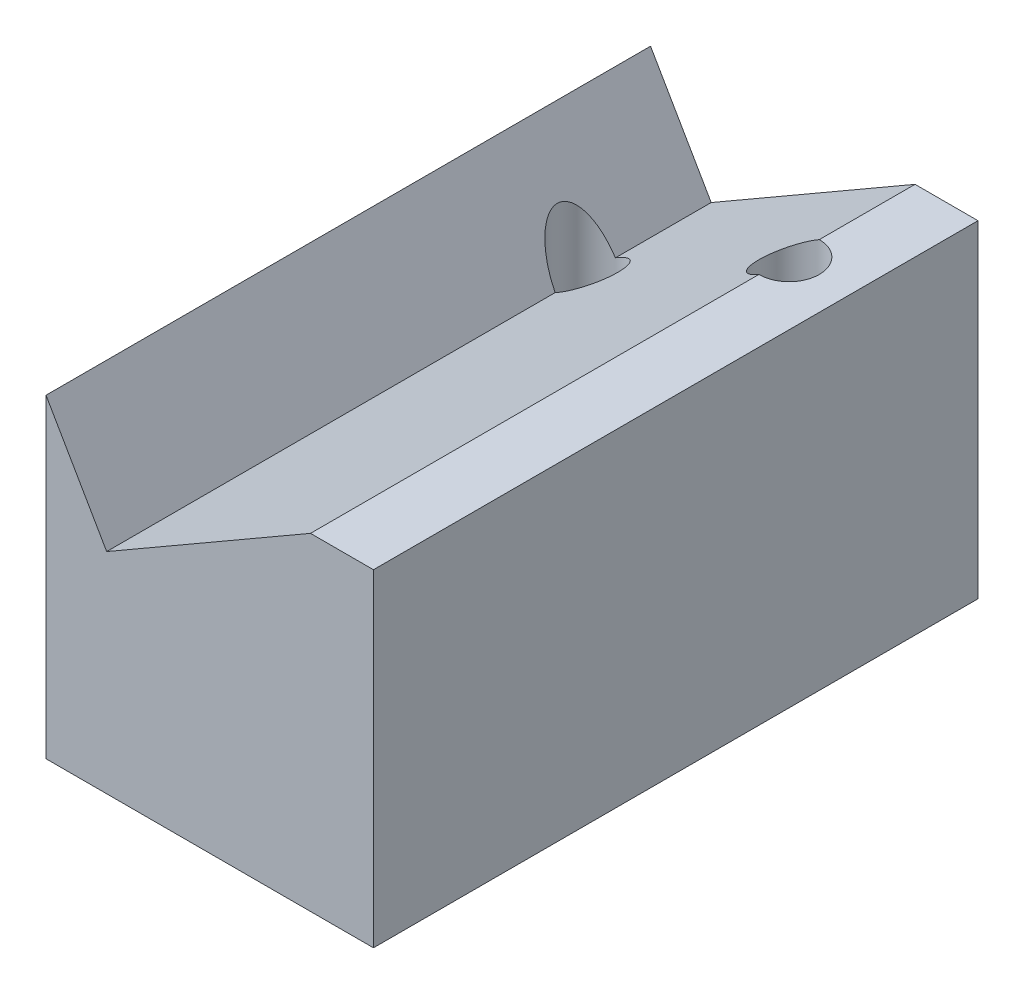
ISO-10303-21;
HEADER;
FILE_DESCRIPTION(('STEP AP214'),'2;1');
FILE_NAME('part.step','',(''),(''),'','','');
FILE_SCHEMA(('AUTOMOTIVE_DESIGN { 1 0 10303 214 1 1 1 1 }'));
ENDSEC;
DATA;
#1=APPLICATION_CONTEXT('core data for automotive mechanical design processes');
#2=APPLICATION_PROTOCOL_DEFINITION('international standard','automotive_design',2000,#1);
#3=PRODUCT_CONTEXT('',#1,'mechanical');
#4=PRODUCT('Part','Part','',(#3));
#5=PRODUCT_RELATED_PRODUCT_CATEGORY('part','',(#4));
#6=PRODUCT_DEFINITION_FORMATION('','',#4);
#7=PRODUCT_DEFINITION_CONTEXT('part definition',#1,'design');
#8=PRODUCT_DEFINITION('design','',#6,#7);
#9=PRODUCT_DEFINITION_SHAPE('','',#8);
#10=(LENGTH_UNIT() NAMED_UNIT(*) SI_UNIT(.MILLI.,.METRE.));
#11=(NAMED_UNIT(*) PLANE_ANGLE_UNIT() SI_UNIT($,.RADIAN.));
#12=(NAMED_UNIT(*) SI_UNIT($,.STERADIAN.) SOLID_ANGLE_UNIT());
#13=UNCERTAINTY_MEASURE_WITH_UNIT(LENGTH_MEASURE(1.E-05),#10,'distance_accuracy_value','');
#14=(GEOMETRIC_REPRESENTATION_CONTEXT(3) GLOBAL_UNCERTAINTY_ASSIGNED_CONTEXT((#13)) GLOBAL_UNIT_ASSIGNED_CONTEXT((#10,
#11,#12)) REPRESENTATION_CONTEXT('',''));
#15=CARTESIAN_POINT('',(0.,0.,0.));
#16=DIRECTION('',(0.,0.,1.));
#17=DIRECTION('',(1.,0.,0.));
#18=AXIS2_PLACEMENT_3D('',#15,#16,#17);
#19=CARTESIAN_POINT('',(-6.50000000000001,0.,24.));
#20=DIRECTION('',(1.,0.,0.));
#21=DIRECTION('',(0.,0.,-1.));
#22=AXIS2_PLACEMENT_3D('',#19,#20,#21);
#23=PLANE('',#22);
#24=DIRECTION('',(0.,-1.,0.));
#25=VECTOR('',#24,1.);
#26=CARTESIAN_POINT('',(-6.50000000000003,0.,0.));
#27=LINE('',#26,#25);
#28=CARTESIAN_POINT('',(-6.50000000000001,12.5,0.));
#29=VERTEX_POINT('',#28);
#30=CARTESIAN_POINT('',(-6.50000000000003,0.,0.));
#31=VERTEX_POINT('',#30);
#32=EDGE_CURVE('E161',#29,#31,#27,.T.);
#33=ORIENTED_EDGE('',*,*,#32,.T.);
#34=DIRECTION('',(0.,0.,-1.));
#35=VECTOR('',#34,1.);
#36=CARTESIAN_POINT('',(-6.50000000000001,0.,24.));
#37=LINE('',#36,#35);
#38=CARTESIAN_POINT('',(-6.50000000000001,0.,24.));
#39=VERTEX_POINT('',#38);
#40=EDGE_CURVE('E120',#39,#31,#37,.T.);
#41=ORIENTED_EDGE('',*,*,#40,.F.);
#42=DIRECTION('',(0.,-1.,0.));
#43=VECTOR('',#42,1.);
#44=CARTESIAN_POINT('',(-6.50000000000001,0.,24.));
#45=LINE('',#44,#43);
#46=CARTESIAN_POINT('',(-6.50000000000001,12.5,24.));
#47=VERTEX_POINT('',#46);
#48=EDGE_CURVE('E142',#47,#39,#45,.T.);
#49=ORIENTED_EDGE('',*,*,#48,.F.);
#50=DIRECTION('',(0.,0.,-1.));
#51=VECTOR('',#50,1.);
#52=CARTESIAN_POINT('',(-6.50000000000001,12.5,24.));
#53=LINE('',#52,#51);
#54=EDGE_CURVE('E109',#47,#29,#53,.T.);
#55=ORIENTED_EDGE('',*,*,#54,.T.);
#56=EDGE_LOOP('',(#33,#41,#49,#55));
#57=FACE_BOUND('',#56,.T.);
#58=ADVANCED_FACE('F28',(#57),#23,.F.);
#59=CARTESIAN_POINT('',(-6.50000000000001,0.,24.));
#60=DIRECTION('',(0.,1.,0.));
#61=DIRECTION('',(0.,0.,1.));
#62=AXIS2_PLACEMENT_3D('',#59,#60,#61);
#63=PLANE('',#62);
#64=CARTESIAN_POINT('',(-4.,0.,5.));
#65=DIRECTION('',(0.,-1.,0.));
#66=DIRECTION('',(0.,0.,-1.));
#67=AXIS2_PLACEMENT_3D('',#64,#65,#66);
#68=CIRCLE('',#67,1.19999999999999);
#69=CARTESIAN_POINT('',(-4.,0.,3.80000000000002));
#70=VERTEX_POINT('',#69);
#71=EDGE_CURVE('E100',#70,#70,#68,.T.);
#72=ORIENTED_EDGE('',*,*,#71,.F.);
#73=EDGE_LOOP('',(#72));
#74=FACE_BOUND('',#73,.T.);
#75=CARTESIAN_POINT('',(4.,0.,5.));
#76=DIRECTION('',(0.,-1.,0.));
#77=DIRECTION('',(0.,0.,-1.));
#78=AXIS2_PLACEMENT_3D('',#75,#76,#77);
#79=CIRCLE('',#78,1.19999999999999);
#80=CARTESIAN_POINT('',(4.,0.,3.80000000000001));
#81=VERTEX_POINT('',#80);
#82=EDGE_CURVE('E163',#81,#81,#79,.T.);
#83=ORIENTED_EDGE('',*,*,#82,.F.);
#84=EDGE_LOOP('',(#83));
#85=FACE_BOUND('',#84,.T.);
#86=DIRECTION('',(1.,0.,0.));
#87=VECTOR('',#86,1.);
#88=CARTESIAN_POINT('',(-6.50000000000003,0.,0.));
#89=LINE('',#88,#87);
#90=CARTESIAN_POINT('',(6.49999999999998,0.,0.));
#91=VERTEX_POINT('',#90);
#92=EDGE_CURVE('E162',#31,#91,#89,.T.);
#93=ORIENTED_EDGE('',*,*,#92,.T.);
#94=DIRECTION('',(0.,0.,-1.));
#95=VECTOR('',#94,1.);
#96=CARTESIAN_POINT('',(6.50000000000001,0.,24.));
#97=LINE('',#96,#95);
#98=CARTESIAN_POINT('',(6.50000000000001,0.,24.));
#99=VERTEX_POINT('',#98);
#100=EDGE_CURVE('E117',#99,#91,#97,.T.);
#101=ORIENTED_EDGE('',*,*,#100,.F.);
#102=DIRECTION('',(1.,0.,0.));
#103=VECTOR('',#102,1.);
#104=CARTESIAN_POINT('',(-6.50000000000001,0.,24.));
#105=LINE('',#104,#103);
#106=EDGE_CURVE('E148',#39,#99,#105,.T.);
#107=ORIENTED_EDGE('',*,*,#106,.F.);
#108=ORIENTED_EDGE('',*,*,#40,.T.);
#109=EDGE_LOOP('',(#93,#101,#107,#108));
#110=FACE_BOUND('',#109,.T.);
#111=ADVANCED_FACE('F174',(#74,#85,#110),#63,.F.);
#112=CARTESIAN_POINT('',(6.50000000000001,0.,24.));
#113=DIRECTION('',(-1.,0.,0.));
#114=DIRECTION('',(0.,-1.,0.));
#115=AXIS2_PLACEMENT_3D('',#112,#113,#114);
#116=PLANE('',#115);
#117=DIRECTION('',(0.,1.,0.));
#118=VECTOR('',#117,1.);
#119=CARTESIAN_POINT('',(6.49999999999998,0.,0.));
#120=LINE('',#119,#118);
#121=CARTESIAN_POINT('',(6.49999999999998,13.,0.));
#122=VERTEX_POINT('',#121);
#123=EDGE_CURVE('E135',#91,#122,#120,.T.);
#124=ORIENTED_EDGE('',*,*,#123,.T.);
#125=DIRECTION('',(0.,0.,-1.));
#126=VECTOR('',#125,1.);
#127=CARTESIAN_POINT('',(6.49999999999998,13.,24.));
#128=LINE('',#127,#126);
#129=CARTESIAN_POINT('',(6.49999999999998,13.,24.));
#130=VERTEX_POINT('',#129);
#131=EDGE_CURVE('E114',#130,#122,#128,.T.);
#132=ORIENTED_EDGE('',*,*,#131,.F.);
#133=DIRECTION('',(0.,1.,0.));
#134=VECTOR('',#133,1.);
#135=CARTESIAN_POINT('',(6.50000000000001,0.,24.));
#136=LINE('',#135,#134);
#137=EDGE_CURVE('E150',#99,#130,#136,.T.);
#138=ORIENTED_EDGE('',*,*,#137,.F.);
#139=ORIENTED_EDGE('',*,*,#100,.T.);
#140=EDGE_LOOP('',(#124,#132,#138,#139));
#141=FACE_BOUND('',#140,.T.);
#142=ADVANCED_FACE('F170',(#141),#116,.F.);
#143=CARTESIAN_POINT('',(6.49999999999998,13.,24.));
#144=DIRECTION('',(0.,-1.,0.));
#145=DIRECTION('',(0.,0.,-1.));
#146=AXIS2_PLACEMENT_3D('',#143,#144,#145);
#147=PLANE('',#146);
#148=DIRECTION('',(0.,0.,-1.));
#149=VECTOR('',#148,1.);
#150=CARTESIAN_POINT('',(3.99999999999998,13.,24.));
#151=LINE('',#150,#149);
#152=CARTESIAN_POINT('',(3.99999999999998,13.,3.8));
#153=VERTEX_POINT('',#152);
#154=CARTESIAN_POINT('',(3.99999999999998,13.,0.));
#155=VERTEX_POINT('',#154);
#156=EDGE_CURVE('E105',#153,#155,#151,.T.);
#157=ORIENTED_EDGE('',*,*,#156,.F.);
#158=CARTESIAN_POINT('',(3.99999999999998,13.,5.));
#159=DIRECTION('',(0.,-1.,0.));
#160=DIRECTION('',(0.,0.,-1.));
#161=AXIS2_PLACEMENT_3D('',#158,#159,#160);
#162=CIRCLE('',#161,1.2);
#163=CARTESIAN_POINT('',(3.99999999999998,13.,6.2));
#164=VERTEX_POINT('',#163);
#165=EDGE_CURVE('E47',#153,#164,#162,.T.);
#166=ORIENTED_EDGE('',*,*,#165,.T.);
#167=CARTESIAN_POINT('',(3.99999999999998,13.,24.));
#168=VERTEX_POINT('',#167);
#169=EDGE_CURVE('E107',#168,#164,#151,.T.);
#170=ORIENTED_EDGE('',*,*,#169,.F.);
#171=DIRECTION('',(-1.,0.,0.));
#172=VECTOR('',#171,1.);
#173=CARTESIAN_POINT('',(6.49999999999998,13.,24.));
#174=LINE('',#173,#172);
#175=EDGE_CURVE('E152',#130,#168,#174,.T.);
#176=ORIENTED_EDGE('',*,*,#175,.F.);
#177=ORIENTED_EDGE('',*,*,#131,.T.);
#178=DIRECTION('',(-1.,0.,0.));
#179=VECTOR('',#178,1.);
#180=CARTESIAN_POINT('',(6.49999999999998,13.,0.));
#181=LINE('',#180,#179);
#182=EDGE_CURVE('E128',#122,#155,#181,.T.);
#183=ORIENTED_EDGE('',*,*,#182,.T.);
#184=EDGE_LOOP('',(#157,#166,#170,#176,#177,#183));
#185=FACE_BOUND('',#184,.T.);
#186=ADVANCED_FACE('F126',(#185),#147,.F.);
#187=CARTESIAN_POINT('',(3.99999999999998,13.,24.));
#188=DIRECTION('',(0.499999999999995,-0.866025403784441,0.));
#189=DIRECTION('',(0.866025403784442,0.499999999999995,0.));
#190=AXIS2_PLACEMENT_3D('',#187,#188,#189);
#191=PLANE('',#190);
#192=DIRECTION('',(0.,0.,-1.));
#193=VECTOR('',#192,1.);
#194=CARTESIAN_POINT('',(-4.09150635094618,8.32836663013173,24.));
#195=LINE('',#194,#193);
#196=CARTESIAN_POINT('',(-4.09150635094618,8.32836663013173,3.80349400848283));
#197=VERTEX_POINT('',#196);
#198=CARTESIAN_POINT('',(-4.09150635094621,8.32836663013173,0.));
#199=VERTEX_POINT('',#198);
#200=EDGE_CURVE('E99',#197,#199,#195,.T.);
#201=ORIENTED_EDGE('',*,*,#200,.F.);
#202=CARTESIAN_POINT('',(-4.00000000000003,8.38119784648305,5.));
#203=DIRECTION('',(0.499999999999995,-0.866025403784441,0.));
#204=DIRECTION('',(-0.866025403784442,-0.499999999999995,0.));
#205=AXIS2_PLACEMENT_3D('',#202,#203,#204);
#206=ELLIPSE('',#205,1.38564064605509,1.19999999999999);
#207=CARTESIAN_POINT('',(-4.09150635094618,8.32836663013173,6.19650599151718));
#208=VERTEX_POINT('',#207);
#209=EDGE_CURVE('E41',#197,#208,#206,.T.);
#210=ORIENTED_EDGE('',*,*,#209,.T.);
#211=CARTESIAN_POINT('',(-4.09150635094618,8.32836663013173,24.));
#212=VERTEX_POINT('',#211);
#213=EDGE_CURVE('E96',#212,#208,#195,.T.);
#214=ORIENTED_EDGE('',*,*,#213,.F.);
#215=DIRECTION('',(-0.866025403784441,-0.499999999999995,0.));
#216=VECTOR('',#215,1.);
#217=CARTESIAN_POINT('',(3.99999999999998,13.,24.));
#218=LINE('',#217,#216);
#219=EDGE_CURVE('E154',#168,#212,#218,.T.);
#220=ORIENTED_EDGE('',*,*,#219,.F.);
#221=ORIENTED_EDGE('',*,*,#169,.T.);
#222=CARTESIAN_POINT('',(3.99999999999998,13.,5.));
#223=DIRECTION('',(0.499999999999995,-0.866025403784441,0.));
#224=DIRECTION('',(-0.866025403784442,-0.499999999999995,0.));
#225=AXIS2_PLACEMENT_3D('',#222,#223,#224);
#226=ELLIPSE('',#225,1.38564064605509,1.19999999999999);
#227=EDGE_CURVE('E35',#164,#153,#226,.T.);
#228=ORIENTED_EDGE('',*,*,#227,.T.);
#229=ORIENTED_EDGE('',*,*,#156,.T.);
#230=DIRECTION('',(-0.866025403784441,-0.499999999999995,0.));
#231=VECTOR('',#230,1.);
#232=CARTESIAN_POINT('',(3.99999999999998,13.,0.));
#233=LINE('',#232,#231);
#234=EDGE_CURVE('E134',#155,#199,#233,.T.);
#235=ORIENTED_EDGE('',*,*,#234,.T.);
#236=EDGE_LOOP('',(#201,#210,#214,#220,#221,#228,#229,#235));
#237=FACE_BOUND('',#236,.T.);
#238=ADVANCED_FACE('F94',(#237),#191,.F.);
#239=CARTESIAN_POINT('',(-4.09150635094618,8.32836663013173,24.));
#240=DIRECTION('',(-0.866025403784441,-0.499999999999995,0.));
#241=DIRECTION('',(0.499999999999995,-0.866025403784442,0.));
#242=AXIS2_PLACEMENT_3D('',#239,#240,#241);
#243=PLANE('',#242);
#244=ORIENTED_EDGE('',*,*,#213,.T.);
#245=CARTESIAN_POINT('',(-4.,8.16987298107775,5.));
#246=DIRECTION('',(-0.866025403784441,-0.499999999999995,0.));
#247=DIRECTION('',(0.499999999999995,-0.866025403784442,0.));
#248=AXIS2_PLACEMENT_3D('',#245,#246,#247);
#249=ELLIPSE('',#248,2.40000000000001,1.19999999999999);
#250=EDGE_CURVE('E11',#208,#197,#249,.T.);
#251=ORIENTED_EDGE('',*,*,#250,.T.);
#252=ORIENTED_EDGE('',*,*,#200,.T.);
#253=DIRECTION('',(-0.499999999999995,0.866025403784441,0.));
#254=VECTOR('',#253,1.);
#255=CARTESIAN_POINT('',(-4.09150635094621,8.32836663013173,0.));
#256=LINE('',#255,#254);
#257=EDGE_CURVE('E140',#199,#29,#256,.T.);
#258=ORIENTED_EDGE('',*,*,#257,.T.);
#259=ORIENTED_EDGE('',*,*,#54,.F.);
#260=DIRECTION('',(-0.499999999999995,0.866025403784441,0.));
#261=VECTOR('',#260,1.);
#262=CARTESIAN_POINT('',(-4.09150635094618,8.32836663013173,24.));
#263=LINE('',#262,#261);
#264=EDGE_CURVE('E104',#212,#47,#263,.T.);
#265=ORIENTED_EDGE('',*,*,#264,.F.);
#266=EDGE_LOOP('',(#244,#251,#252,#258,#259,#265));
#267=FACE_BOUND('',#266,.T.);
#268=ADVANCED_FACE('F102',(#267),#243,.F.);
#269=CARTESIAN_POINT('',(-6.50000000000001,13.,24.));
#270=DIRECTION('',(0.,0.,1.));
#271=DIRECTION('',(1.,0.,0.));
#272=AXIS2_PLACEMENT_3D('',#269,#270,#271);
#273=PLANE('',#272);
#274=ORIENTED_EDGE('',*,*,#48,.T.);
#275=ORIENTED_EDGE('',*,*,#106,.T.);
#276=ORIENTED_EDGE('',*,*,#137,.T.);
#277=ORIENTED_EDGE('',*,*,#175,.T.);
#278=ORIENTED_EDGE('',*,*,#219,.T.);
#279=ORIENTED_EDGE('',*,*,#264,.T.);
#280=EDGE_LOOP('',(#274,#275,#276,#277,#278,#279));
#281=FACE_BOUND('',#280,.T.);
#282=ADVANCED_FACE('F175',(#281),#273,.T.);
#283=CARTESIAN_POINT('',(-6.50000000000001,13.,0.));
#284=DIRECTION('',(0.,0.,1.));
#285=DIRECTION('',(1.,0.,0.));
#286=AXIS2_PLACEMENT_3D('',#283,#284,#285);
#287=PLANE('',#286);
#288=ORIENTED_EDGE('',*,*,#32,.F.);
#289=ORIENTED_EDGE('',*,*,#257,.F.);
#290=ORIENTED_EDGE('',*,*,#234,.F.);
#291=ORIENTED_EDGE('',*,*,#182,.F.);
#292=ORIENTED_EDGE('',*,*,#123,.F.);
#293=ORIENTED_EDGE('',*,*,#92,.F.);
#294=EDGE_LOOP('',(#288,#289,#290,#291,#292,#293));
#295=FACE_BOUND('',#294,.T.);
#296=ADVANCED_FACE('F139',(#295),#287,.F.);
#297=CARTESIAN_POINT('',(4.,0.,5.));
#298=DIRECTION('',(0.,-1.,0.));
#299=DIRECTION('',(0.,0.,-1.));
#300=AXIS2_PLACEMENT_3D('',#297,#298,#299);
#301=CYLINDRICAL_SURFACE('',#300,1.19999999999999);
#302=ORIENTED_EDGE('',*,*,#82,.T.);
#303=EDGE_LOOP('',(#302));
#304=FACE_BOUND('',#303,.T.);
#305=ORIENTED_EDGE('',*,*,#165,.F.);
#306=ORIENTED_EDGE('',*,*,#227,.F.);
#307=EDGE_LOOP('',(#305,#306));
#308=FACE_BOUND('',#307,.T.);
#309=ADVANCED_FACE('F182',(#304,#308),#301,.F.);
#310=CARTESIAN_POINT('',(-4.,0.,5.));
#311=DIRECTION('',(0.,-1.,0.));
#312=DIRECTION('',(0.,0.,-1.));
#313=AXIS2_PLACEMENT_3D('',#310,#311,#312);
#314=CYLINDRICAL_SURFACE('',#313,1.19999999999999);
#315=ORIENTED_EDGE('',*,*,#71,.T.);
#316=EDGE_LOOP('',(#315));
#317=FACE_BOUND('',#316,.T.);
#318=ORIENTED_EDGE('',*,*,#250,.F.);
#319=ORIENTED_EDGE('',*,*,#209,.F.);
#320=EDGE_LOOP('',(#318,#319));
#321=FACE_BOUND('',#320,.T.);
#322=ADVANCED_FACE('F88',(#317,#321),#314,.F.);
#323=CLOSED_SHELL('',(#58,#111,#142,#186,#238,#268,#282,#296,#309,#322));
#324=MANIFOLD_SOLID_BREP('B2',#323);
#325=ADVANCED_BREP_SHAPE_REPRESENTATION('',(#18,#324),#14);
#326=SHAPE_DEFINITION_REPRESENTATION(#9,#325);
ENDSEC;
END-ISO-10303-21;
